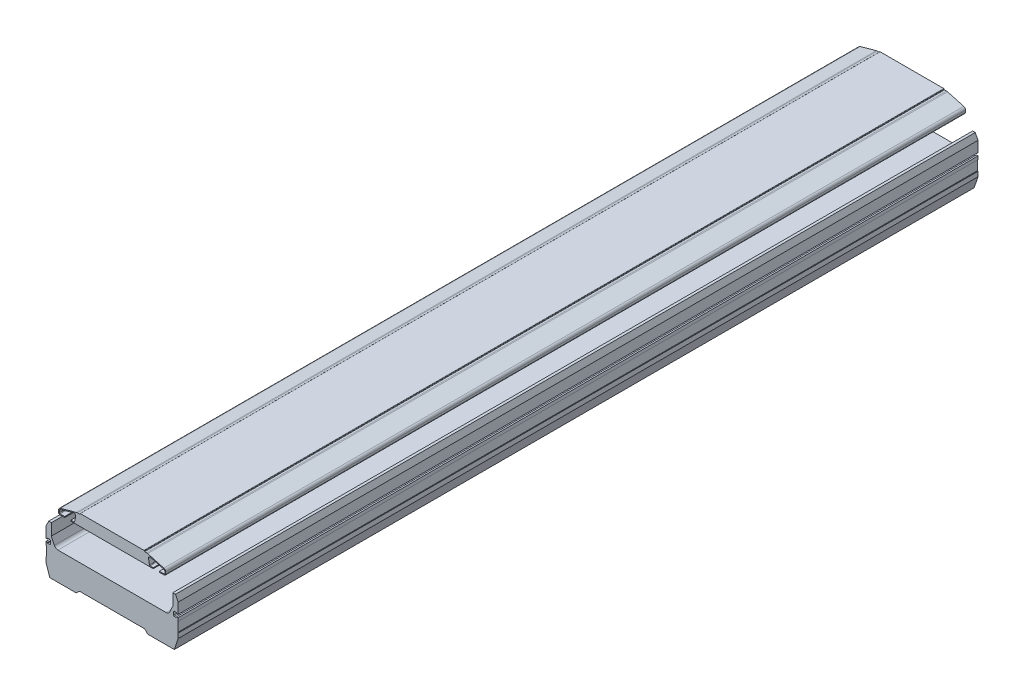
from build123d import *

# Parameters (mm, degrees)
EXTRUDE_1_DEPTH              = 1029
EXTRUDE_1_2_DEPTH            = 1029
HOLE_WIZARD_1_AT_2_COUNT     = 2
HOLE_WIZARD_1_AT_2_PITCH     = 140
HOLE_WIZARD_1_AT_3_COUNT     = 2
HOLE_WIZARD_1_AT_3_PITCH     = 172.046505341
HOLE_WIZARD_1_AT_4_COUNT     = 2
HOLE_WIZARD_1_AT_4_PITCH     = 100
HOLE_WIZARD_1_AT_5_COUNT     = 2
HOLE_WIZARD_1_AT_5_PITCH     = 331.058907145
HOLE_WIZARD_1_AT_6_COUNT     = 2
HOLE_WIZARD_1_AT_6_PITCH     = 300
HOLE_WIZARD_1_AT_7_COUNT     = 2
HOLE_WIZARD_1_AT_7_PITCH     = 519.23019943
HOLE_WIZARD_1_AT_8_COUNT     = 2
HOLE_WIZARD_1_AT_8_PITCH     = 500
HOLE_WIZARD_1_AT_9_COUNT     = 2
HOLE_WIZARD_1_AT_9_PITCH     = 713.862731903
HOLE_WIZARD_1_AT_10_COUNT    = 2
HOLE_WIZARD_1_AT_10_PITCH    = 700
HOLE_WIZARD_1_AT_11_COUNT    = 2
HOLE_WIZARD_1_AT_11_PITCH    = 910.823802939
HOLE_WIZARD_1_AT_12_COUNT    = 2
HOLE_WIZARD_1_AT_12_PITCH    = 900
HOLE_WIZARD_M8_1_AT_2_COUNT  = 2
HOLE_WIZARD_M8_1_AT_2_PITCH  = 140
HOLE_WIZARD_M8_1_AT_3_COUNT  = 2
HOLE_WIZARD_M8_1_AT_3_PITCH  = 100
HOLE_WIZARD_M8_1_AT_4_COUNT  = 2
HOLE_WIZARD_M8_1_AT_4_PITCH  = 172.046505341
HOLE_WIZARD_M8_1_AT_5_COUNT  = 2
HOLE_WIZARD_M8_1_AT_5_PITCH  = 331.058907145
HOLE_WIZARD_M8_1_AT_6_COUNT  = 2
HOLE_WIZARD_M8_1_AT_6_PITCH  = 300
HOLE_WIZARD_M8_1_AT_7_COUNT  = 2
HOLE_WIZARD_M8_1_AT_7_PITCH  = 519.23019943
HOLE_WIZARD_M8_1_AT_8_COUNT  = 2
HOLE_WIZARD_M8_1_AT_8_PITCH  = 500
HOLE_WIZARD_M8_1_AT_9_COUNT  = 2
HOLE_WIZARD_M8_1_AT_9_PITCH  = 713.862731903
HOLE_WIZARD_M8_1_AT_10_COUNT = 2
HOLE_WIZARD_M8_1_AT_10_PITCH = 700
HOLE_WIZARD_M8_1_AT_11_COUNT = 2
HOLE_WIZARD_M8_1_AT_11_PITCH = 910.823802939
HOLE_WIZARD_M8_1_AT_12_COUNT = 2
HOLE_WIZARD_M8_1_AT_12_PITCH = 900


with BuildPart() as part:
    # Sketch 1 → Extrude 1 (new body)
    with BuildSketch(Plane.XY):
        with BuildLine():
            Line((41, 87), (-41, 87))
            ThreePointArc((-41, 87), (-41.353553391, 86.853553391), (-41.5, 86.5))
            ThreePointArc((-41.5, 86.5), (-41.646446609, 86.146446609), (-42, 86))
            Line((-42, 86), (-44.425413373, 86))
            ThreePointArc((-44.425413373, 86), (-45.099668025, 85.954329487), (-45.761605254, 85.818152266))
            Line((-45.761605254, 85.818152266), (-66.655162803, 80.023855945))
            ThreePointArc((-66.655162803, 80.023855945), (-68.347206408, 78.877179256), (-69, 76.940238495))
            Line((-69, 76.940238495), (-69, 74.5))
            ThreePointArc((-69, 74.5), (-68.414213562, 73.085786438), (-67, 72.5))
            Line((-67, 72.5), (-61, 72.5))
            Line((-61, 72.5), (-61, 73.7))
            Line((-61, 73.7), (-67, 73.7))
            ThreePointArc((-67, 73.7), (-67.565685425, 73.934314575), (-67.8, 74.5))
            Line((-67.8, 74.5), (-67.8, 76.940238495))
            ThreePointArc((-67.8, 76.940238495), (-67.392004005, 78.150826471), (-66.334476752, 78.867499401))
            Line((-66.334476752, 78.867499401), (-49.610647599, 83.505427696))
            ThreePointArc((-49.610647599, 83.505427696), (-47.555281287, 83.011977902), (-46.884572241, 81.007439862))
            Line((-46.884572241, 81.007439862), (-48.117675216, 74.35421158))
            ThreePointArc((-48.117675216, 74.35421158), (-48.392727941, 73.884926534), (-48.904279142, 73.7))
            Line((-48.904279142, 73.7), (-53, 73.7))
            Line((-53, 73.7), (-53, 72.5))
            Line((-53, 72.5), (53, 72.5))
            Line((53, 72.5), (53, 73.7))
            Line((53, 73.7), (48.904279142, 73.7))
            ThreePointArc((48.904279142, 73.7), (48.392727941, 73.884926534), (48.117675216, 74.35421158))
            Line((48.117675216, 74.35421158), (46.884572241, 81.007439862))
            ThreePointArc((46.884572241, 81.007439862), (47.555281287, 83.011977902), (49.610647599, 83.505427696))
            Line((49.610647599, 83.505427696), (66.334476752, 78.867499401))
            ThreePointArc((66.334476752, 78.867499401), (67.392004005, 78.150826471), (67.8, 76.940238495))
            Line((67.8, 76.940238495), (67.8, 74.5))
            ThreePointArc((67.8, 74.5), (67.565685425, 73.934314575), (67, 73.7))
            Line((67, 73.7), (61, 73.7))
            Line((61, 73.7), (61, 72.5))
            Line((61, 72.5), (67, 72.5))
            ThreePointArc((67, 72.5), (68.414213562, 73.085786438), (69, 74.5))
            Line((69, 74.5), (69, 76.940238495))
            ThreePointArc((69, 76.940238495), (68.347206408, 78.877179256), (66.655162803, 80.023855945))
            Line((66.655162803, 80.023855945), (45.761605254, 85.818152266))
            ThreePointArc((45.761605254, 85.818152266), (45.099668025, 85.954329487), (44.425413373, 86))
            Line((44.425413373, 86), (42, 86))
            ThreePointArc((42, 86), (41.646446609, 86.146446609), (41.5, 86.5))
            ThreePointArc((41.5, 86.5), (41.353553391, 86.853553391), (41, 87))
        make_face()
    extrude(amount=-EXTRUDE_1_DEPTH)


with BuildPart() as body_2:
    # Sketch 1 → Extrude 1 2 (new body)
    with BuildSketch(Plane.XY):
        with BuildLine():
            Line((69.645372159, 32), (-69.645372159, 32))
            ThreePointArc((-69.645372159, 32), (-72.331870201, 32.783042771), (-74.176911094, 34.886908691))
            Line((-74.176911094, 34.886908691), (-78.1, 43.3))
            Line((-78.1, 43.3), (-78.1, 58.3))
            Line((-78.1, 58.3), (-81.5, 58.3))
            Line((-81.5, 58.3), (-85, 51.3))
            Line((-85, 51.3), (-85, 37.6))
            Line((-85, 37.6), (-83, 37.6))
            Line((-83, 37.6), (-83, 38.7))
            Line((-83, 38.7), (-80.2, 38.7))
            ThreePointArc((-80.2, 38.7), (-79.492893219, 38.407106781), (-79.2, 37.7))
            Line((-79.2, 37.7), (-79.2, 33.9))
            ThreePointArc((-79.2, 33.9), (-79.492893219, 33.192893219), (-80.2, 32.9))
            Line((-80.2, 32.9), (-83, 32.9))
            Line((-83, 32.9), (-83, 34))
            Line((-83, 34), (-85, 34))
            Line((-85, 34), (-85, 29.8))
            Line((-85, 29.8), (-84.5, 29.3))
            Line((-84.5, 29.3), (-84.5, 17.3))
            Line((-84.5, 17.3), (-85, 16.8))
            Line((-85, 16.8), (-85, 10.7))
            Line((-85, 10.7), (-80.1, -4))
            Line((-80.1, -4), (-46, -4))
            Line((-46, -4), (-42, 0))
            Line((-42, 0), (42, 0))
            Line((42, 0), (46, -4))
            Line((46, -4), (80.1, -4))
            Line((80.1, -4), (85, 10.7))
            Line((85, 10.7), (85, 16.8))
            Line((85, 16.8), (84.5, 17.3))
            Line((84.5, 17.3), (84.5, 29.3))
            Line((84.5, 29.3), (85, 29.8))
            Line((85, 29.8), (85, 34))
            Line((85, 34), (83, 34))
            Line((83, 34), (83, 32.9))
            Line((83, 32.9), (80.2, 32.9))
            ThreePointArc((80.2, 32.9), (79.492893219, 33.192893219), (79.2, 33.9))
            Line((79.2, 33.9), (79.2, 37.7))
            ThreePointArc((79.2, 37.7), (79.492893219, 38.407106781), (80.2, 38.7))
            Line((80.2, 38.7), (83, 38.7))
            Line((83, 38.7), (83, 37.6))
            Line((83, 37.6), (85, 37.6))
            Line((85, 37.6), (85, 51.3))
            Line((85, 51.3), (81.5, 58.3))
            Line((81.5, 58.3), (78.1, 58.3))
            Line((78.1, 58.3), (78.1, 43.3))
            Line((78.1, 43.3), (74.176911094, 34.886908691))
            ThreePointArc((74.176911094, 34.886908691), (72.331870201, 32.783042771), (69.645372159, 32))
        make_face()
    extrude(amount=-EXTRUDE_1_2_DEPTH)

    # Sketch 4 → Hole Wizard 1 (revolve, cut)
    with BuildSketch(Plane(origin=(-70, 58.3, -955.5), x_dir=(0, 0, 1), z_dir=(1, 0, 0))):
        Polygon((0, 0), (0, 62.3), (4.5, 62.3), (4.5, 48.3), (7.5, 48.3), (7.5, 0), align=None)
    hole_wizard_1 = revolve(axis=Axis((-70, 64.65, -955.5), (0, -1, 0)), mode=Mode.SUBTRACT)

    # Hole Wizard 1 at 2: Hole Wizard 1 ×2
    with Locations(*[(i * HOLE_WIZARD_1_AT_2_PITCH, 0, 0) for i in range(1, HOLE_WIZARD_1_AT_2_COUNT)]):
        add(hole_wizard_1, mode=Mode.SUBTRACT)

    # Hole Wizard 1 at 3: Hole Wizard 1 ×2
    with Locations(*[Vector(0.813733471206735, 0, 0.5812381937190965) * (i * HOLE_WIZARD_1_AT_3_PITCH) for i in range(1, HOLE_WIZARD_1_AT_3_COUNT)]):
        add(hole_wizard_1, mode=Mode.SUBTRACT)

    # Hole Wizard 1 at 4: Hole Wizard 1 ×2
    with Locations(*[(0, 0, i * HOLE_WIZARD_1_AT_4_PITCH) for i in range(1, HOLE_WIZARD_1_AT_4_COUNT)]):
        add(hole_wizard_1, mode=Mode.SUBTRACT)

    # Hole Wizard 1 at 5: Hole Wizard 1 ×2
    with Locations(*[Vector(0.42288546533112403, 0, 0.9061831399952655) * (i * HOLE_WIZARD_1_AT_5_PITCH) for i in range(1, HOLE_WIZARD_1_AT_5_COUNT)]):
        add(hole_wizard_1, mode=Mode.SUBTRACT)

    # Hole Wizard 1 at 6: Hole Wizard 1 ×2
    with Locations(*[(0, 0, i * HOLE_WIZARD_1_AT_6_PITCH) for i in range(1, HOLE_WIZARD_1_AT_6_COUNT)]):
        add(hole_wizard_1, mode=Mode.SUBTRACT)

    # Hole Wizard 1 at 7: Hole Wizard 1 ×2
    with Locations(*[Vector(0.26962992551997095, 0, 0.9629640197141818) * (i * HOLE_WIZARD_1_AT_7_PITCH) for i in range(1, HOLE_WIZARD_1_AT_7_COUNT)]):
        add(hole_wizard_1, mode=Mode.SUBTRACT)

    # Hole Wizard 1 at 8: Hole Wizard 1 ×2
    with Locations(*[(0, 0, i * HOLE_WIZARD_1_AT_8_PITCH) for i in range(1, HOLE_WIZARD_1_AT_8_COUNT)]):
        add(hole_wizard_1, mode=Mode.SUBTRACT)

    # Hole Wizard 1 at 9: Hole Wizard 1 ×2
    with Locations(*[Vector(0.19611613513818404, 0, 0.9805806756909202) * (i * HOLE_WIZARD_1_AT_9_PITCH) for i in range(1, HOLE_WIZARD_1_AT_9_COUNT)]):
        add(hole_wizard_1, mode=Mode.SUBTRACT)

    # Hole Wizard 1 at 10: Hole Wizard 1 ×2
    with Locations(*[(0, 0, i * HOLE_WIZARD_1_AT_10_PITCH) for i in range(1, HOLE_WIZARD_1_AT_10_COUNT)]):
        add(hole_wizard_1, mode=Mode.SUBTRACT)

    # Hole Wizard 1 at 11: Hole Wizard 1 ×2
    with Locations(*[Vector(0.1537070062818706, 0, 0.9881164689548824) * (i * HOLE_WIZARD_1_AT_11_PITCH) for i in range(1, HOLE_WIZARD_1_AT_11_COUNT)]):
        add(hole_wizard_1, mode=Mode.SUBTRACT)

    # Hole Wizard 1 at 12: Hole Wizard 1 ×2
    with Locations(*[(0, 0, i * HOLE_WIZARD_1_AT_12_PITCH) for i in range(1, HOLE_WIZARD_1_AT_12_COUNT)]):
        add(hole_wizard_1, mode=Mode.SUBTRACT)

    # Sketch 6 → Hole Wizard M8 _1 (revolve, cut)
    with BuildSketch(Plane(origin=(-70, -4, -970.5), x_dir=(0, 0, -1), z_dir=(1, 0, 0))):
        Polygon((0, 0), (0, 21.792926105), (3.4, 19.75), (3.4, 0), align=None)
    hole_wizard_m8_1 = revolve(axis=Axis((-70, -10.35, -970.5), (0, 1, 0)), mode=Mode.SUBTRACT)

    # Hole Wizard M8 _1 at 2: Hole Wizard M8 _1 ×2
    with Locations(*[(i * HOLE_WIZARD_M8_1_AT_2_PITCH, 0, 0) for i in range(1, HOLE_WIZARD_M8_1_AT_2_COUNT)]):
        add(hole_wizard_m8_1, mode=Mode.SUBTRACT)

    # Hole Wizard M8 _1 at 3: Hole Wizard M8 _1 ×2
    with Locations(*[(0, 0, i * HOLE_WIZARD_M8_1_AT_3_PITCH) for i in range(1, HOLE_WIZARD_M8_1_AT_3_COUNT)]):
        add(hole_wizard_m8_1, mode=Mode.SUBTRACT)

    # Hole Wizard M8 _1 at 4: Hole Wizard M8 _1 ×2
    with Locations(*[Vector(0.8137334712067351, -5.260518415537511e-15, 0.5812381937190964) * (i * HOLE_WIZARD_M8_1_AT_4_PITCH) for i in range(1, HOLE_WIZARD_M8_1_AT_4_COUNT)]):
        add(hole_wizard_m8_1, mode=Mode.SUBTRACT)

    # Hole Wizard M8 _1 at 5: Hole Wizard M8 _1 ×2
    with Locations(*[Vector(0.422885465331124, -2.733815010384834e-15, 0.9061831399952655) * (i * HOLE_WIZARD_M8_1_AT_5_PITCH) for i in range(1, HOLE_WIZARD_M8_1_AT_5_COUNT)]):
        add(hole_wizard_m8_1, mode=Mode.SUBTRACT)

    # Hole Wizard M8 _1 at 6: Hole Wizard M8 _1 ×2
    with Locations(*[(0, 0, i * HOLE_WIZARD_M8_1_AT_6_PITCH) for i in range(1, HOLE_WIZARD_M8_1_AT_6_COUNT)]):
        add(hole_wizard_m8_1, mode=Mode.SUBTRACT)

    # Hole Wizard M8 _1 at 7: Hole Wizard M8 _1 ×2
    with Locations(*[Vector(0.269629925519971, -1.743068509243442e-15, 0.9629640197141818) * (i * HOLE_WIZARD_M8_1_AT_7_PITCH) for i in range(1, HOLE_WIZARD_M8_1_AT_7_COUNT)]):
        add(hole_wizard_m8_1, mode=Mode.SUBTRACT)

    # Hole Wizard M8 _1 at 8: Hole Wizard M8 _1 ×2
    with Locations(*[(0, 0, i * HOLE_WIZARD_M8_1_AT_8_PITCH) for i in range(1, HOLE_WIZARD_M8_1_AT_8_COUNT)]):
        add(hole_wizard_m8_1, mode=Mode.SUBTRACT)

    # Hole Wizard M8 _1 at 9: Hole Wizard M8 _1 ×2
    with Locations(*[Vector(0.1961161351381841, -1.2678261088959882e-15, 0.9805806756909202) * (i * HOLE_WIZARD_M8_1_AT_9_PITCH) for i in range(1, HOLE_WIZARD_M8_1_AT_9_COUNT)]):
        add(hole_wizard_m8_1, mode=Mode.SUBTRACT)

    # Hole Wizard M8 _1 at 10: Hole Wizard M8 _1 ×2
    with Locations(*[(0, 0, i * HOLE_WIZARD_M8_1_AT_10_PITCH) for i in range(1, HOLE_WIZARD_M8_1_AT_10_COUNT)]):
        add(hole_wizard_m8_1, mode=Mode.SUBTRACT)

    # Hole Wizard M8 _1 at 11: Hole Wizard M8 _1 ×2
    with Locations(*[Vector(0.15370700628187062, 0, 0.9881164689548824) * (i * HOLE_WIZARD_M8_1_AT_11_PITCH) for i in range(1, HOLE_WIZARD_M8_1_AT_11_COUNT)]):
        add(hole_wizard_m8_1, mode=Mode.SUBTRACT)

    # Hole Wizard M8 _1 at 12: Hole Wizard M8 _1 ×2
    with Locations(*[(0, 0, i * HOLE_WIZARD_M8_1_AT_12_PITCH) for i in range(1, HOLE_WIZARD_M8_1_AT_12_COUNT)]):
        add(hole_wizard_m8_1, mode=Mode.SUBTRACT)


solid = Compound([part.part, body_2.part])
